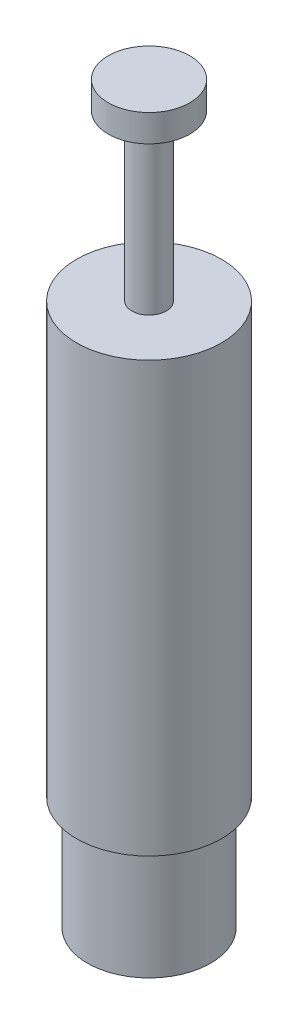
ISO-10303-21;
HEADER;
FILE_DESCRIPTION(('STEP AP214'),'2;1');
FILE_NAME('part.step','',(''),(''),'','','');
FILE_SCHEMA(('AUTOMOTIVE_DESIGN { 1 0 10303 214 1 1 1 1 }'));
ENDSEC;
DATA;
#1=APPLICATION_CONTEXT('core data for automotive mechanical design processes');
#2=APPLICATION_PROTOCOL_DEFINITION('international standard','automotive_design',2000,#1);
#3=PRODUCT_CONTEXT('',#1,'mechanical');
#4=PRODUCT('Part','Part','',(#3));
#5=PRODUCT_RELATED_PRODUCT_CATEGORY('part','',(#4));
#6=PRODUCT_DEFINITION_FORMATION('','',#4);
#7=PRODUCT_DEFINITION_CONTEXT('part definition',#1,'design');
#8=PRODUCT_DEFINITION('design','',#6,#7);
#9=PRODUCT_DEFINITION_SHAPE('','',#8);
#10=(LENGTH_UNIT() NAMED_UNIT(*) SI_UNIT(.MILLI.,.METRE.));
#11=(NAMED_UNIT(*) PLANE_ANGLE_UNIT() SI_UNIT($,.RADIAN.));
#12=(NAMED_UNIT(*) SI_UNIT($,.STERADIAN.) SOLID_ANGLE_UNIT());
#13=UNCERTAINTY_MEASURE_WITH_UNIT(LENGTH_MEASURE(1.E-05),#10,'distance_accuracy_value','');
#14=(GEOMETRIC_REPRESENTATION_CONTEXT(3) GLOBAL_UNCERTAINTY_ASSIGNED_CONTEXT((#13)) GLOBAL_UNIT_ASSIGNED_CONTEXT((#10,
#11,#12)) REPRESENTATION_CONTEXT('',''));
#15=CARTESIAN_POINT('',(0.,0.,0.));
#16=DIRECTION('',(0.,0.,1.));
#17=DIRECTION('',(1.,0.,0.));
#18=AXIS2_PLACEMENT_3D('',#15,#16,#17);
#19=CARTESIAN_POINT('',(0.,0.,0.));
#20=DIRECTION('',(0.,-1.,0.));
#21=DIRECTION('',(0.,0.,-1.));
#22=AXIS2_PLACEMENT_3D('',#19,#20,#21);
#23=PLANE('',#22);
#24=CARTESIAN_POINT('',(0.,0.,0.));
#25=DIRECTION('',(0.,-1.,0.));
#26=DIRECTION('',(0.,0.,-1.));
#27=AXIS2_PLACEMENT_3D('',#24,#25,#26);
#28=CIRCLE('',#27,3.4);
#29=CARTESIAN_POINT('',(0.,0.,-3.4));
#30=VERTEX_POINT('',#29);
#31=EDGE_CURVE('E10',#30,#30,#28,.T.);
#32=ORIENTED_EDGE('',*,*,#31,.T.);
#33=EDGE_LOOP('',(#32));
#34=FACE_BOUND('',#33,.T.);
#35=ADVANCED_FACE('F32',(#34),#23,.T.);
#36=CARTESIAN_POINT('',(0.,0.,0.));
#37=DIRECTION('',(0.,-1.,0.));
#38=DIRECTION('',(0.,0.,-1.));
#39=AXIS2_PLACEMENT_3D('',#36,#37,#38);
#40=CYLINDRICAL_SURFACE('',#39,3.4);
#41=CARTESIAN_POINT('',(0.,6.25,0.));
#42=DIRECTION('',(0.,-1.,0.));
#43=DIRECTION('',(0.,0.,-1.));
#44=AXIS2_PLACEMENT_3D('',#41,#42,#43);
#45=CIRCLE('',#44,3.4);
#46=CARTESIAN_POINT('',(0.,6.25,-3.4));
#47=VERTEX_POINT('',#46);
#48=EDGE_CURVE('E38',#47,#47,#45,.T.);
#49=ORIENTED_EDGE('',*,*,#48,.T.);
#50=EDGE_LOOP('',(#49));
#51=FACE_BOUND('',#50,.T.);
#52=ORIENTED_EDGE('',*,*,#31,.F.);
#53=EDGE_LOOP('',(#52));
#54=FACE_BOUND('',#53,.T.);
#55=ADVANCED_FACE('F76',(#51,#54),#40,.T.);
#56=CARTESIAN_POINT('',(3.4,6.25,0.));
#57=DIRECTION('',(0.,-1.,0.));
#58=DIRECTION('',(0.,0.,-1.));
#59=AXIS2_PLACEMENT_3D('',#56,#57,#58);
#60=PLANE('',#59);
#61=CARTESIAN_POINT('',(0.,6.25,0.));
#62=DIRECTION('',(0.,-1.,0.));
#63=DIRECTION('',(0.,0.,-1.));
#64=AXIS2_PLACEMENT_3D('',#61,#62,#63);
#65=CIRCLE('',#64,4.);
#66=CARTESIAN_POINT('',(0.,6.25,-4.));
#67=VERTEX_POINT('',#66);
#68=EDGE_CURVE('E42',#67,#67,#65,.T.);
#69=ORIENTED_EDGE('',*,*,#68,.T.);
#70=EDGE_LOOP('',(#69));
#71=FACE_BOUND('',#70,.T.);
#72=ORIENTED_EDGE('',*,*,#48,.F.);
#73=EDGE_LOOP('',(#72));
#74=FACE_BOUND('',#73,.T.);
#75=ADVANCED_FACE('F80',(#71,#74),#60,.T.);
#76=CARTESIAN_POINT('',(0.,0.,0.));
#77=DIRECTION('',(0.,-1.,0.));
#78=DIRECTION('',(0.,0.,-1.));
#79=AXIS2_PLACEMENT_3D('',#76,#77,#78);
#80=CYLINDRICAL_SURFACE('',#79,4.);
#81=CARTESIAN_POINT('',(0.,29.95,0.));
#82=DIRECTION('',(0.,-1.,0.));
#83=DIRECTION('',(0.,0.,-1.));
#84=AXIS2_PLACEMENT_3D('',#81,#82,#83);
#85=CIRCLE('',#84,4.);
#86=CARTESIAN_POINT('',(0.,29.95,-4.));
#87=VERTEX_POINT('',#86);
#88=EDGE_CURVE('E46',#87,#87,#85,.T.);
#89=ORIENTED_EDGE('',*,*,#88,.T.);
#90=EDGE_LOOP('',(#89));
#91=FACE_BOUND('',#90,.T.);
#92=ORIENTED_EDGE('',*,*,#68,.F.);
#93=EDGE_LOOP('',(#92));
#94=FACE_BOUND('',#93,.T.);
#95=ADVANCED_FACE('F84',(#91,#94),#80,.T.);
#96=CARTESIAN_POINT('',(4.,29.95,0.));
#97=DIRECTION('',(0.,1.,0.));
#98=DIRECTION('',(0.,0.,1.));
#99=AXIS2_PLACEMENT_3D('',#96,#97,#98);
#100=PLANE('',#99);
#101=CARTESIAN_POINT('',(0.,29.95,0.));
#102=DIRECTION('',(0.,-1.,0.));
#103=DIRECTION('',(0.,0.,-1.));
#104=AXIS2_PLACEMENT_3D('',#101,#102,#103);
#105=CIRCLE('',#104,0.95);
#106=CARTESIAN_POINT('',(0.,29.95,-0.95));
#107=VERTEX_POINT('',#106);
#108=EDGE_CURVE('E51',#107,#107,#105,.T.);
#109=ORIENTED_EDGE('',*,*,#108,.T.);
#110=EDGE_LOOP('',(#109));
#111=FACE_BOUND('',#110,.T.);
#112=ORIENTED_EDGE('',*,*,#88,.F.);
#113=EDGE_LOOP('',(#112));
#114=FACE_BOUND('',#113,.T.);
#115=ADVANCED_FACE('F91',(#111,#114),#100,.T.);
#116=CARTESIAN_POINT('',(0.,0.,0.));
#117=DIRECTION('',(0.,-1.,0.));
#118=DIRECTION('',(0.,0.,-1.));
#119=AXIS2_PLACEMENT_3D('',#116,#117,#118);
#120=CYLINDRICAL_SURFACE('',#119,0.95);
#121=CARTESIAN_POINT('',(0.,39.05,0.));
#122=DIRECTION('',(0.,-1.,0.));
#123=DIRECTION('',(0.,0.,-1.));
#124=AXIS2_PLACEMENT_3D('',#121,#122,#123);
#125=CIRCLE('',#124,0.95);
#126=CARTESIAN_POINT('',(0.,39.05,-0.95));
#127=VERTEX_POINT('',#126);
#128=EDGE_CURVE('E54',#127,#127,#125,.T.);
#129=ORIENTED_EDGE('',*,*,#128,.T.);
#130=EDGE_LOOP('',(#129));
#131=FACE_BOUND('',#130,.T.);
#132=ORIENTED_EDGE('',*,*,#108,.F.);
#133=EDGE_LOOP('',(#132));
#134=FACE_BOUND('',#133,.T.);
#135=ADVANCED_FACE('F95',(#131,#134),#120,.T.);
#136=CARTESIAN_POINT('',(0.95,39.05,0.));
#137=DIRECTION('',(0.,-1.,0.));
#138=DIRECTION('',(0.,0.,-1.));
#139=AXIS2_PLACEMENT_3D('',#136,#137,#138);
#140=PLANE('',#139);
#141=CARTESIAN_POINT('',(0.,39.05,0.));
#142=DIRECTION('',(0.,-1.,0.));
#143=DIRECTION('',(0.,0.,-1.));
#144=AXIS2_PLACEMENT_3D('',#141,#142,#143);
#145=CIRCLE('',#144,2.25);
#146=CARTESIAN_POINT('',(0.,39.05,-2.25));
#147=VERTEX_POINT('',#146);
#148=EDGE_CURVE('E57',#147,#147,#145,.T.);
#149=ORIENTED_EDGE('',*,*,#148,.T.);
#150=EDGE_LOOP('',(#149));
#151=FACE_BOUND('',#150,.T.);
#152=ORIENTED_EDGE('',*,*,#128,.F.);
#153=EDGE_LOOP('',(#152));
#154=FACE_BOUND('',#153,.T.);
#155=ADVANCED_FACE('F73',(#151,#154),#140,.T.);
#156=CARTESIAN_POINT('',(0.,0.,0.));
#157=DIRECTION('',(0.,-1.,0.));
#158=DIRECTION('',(0.,0.,-1.));
#159=AXIS2_PLACEMENT_3D('',#156,#157,#158);
#160=CYLINDRICAL_SURFACE('',#159,2.25);
#161=CARTESIAN_POINT('',(0.,40.55,0.));
#162=DIRECTION('',(0.,-1.,0.));
#163=DIRECTION('',(0.,0.,-1.));
#164=AXIS2_PLACEMENT_3D('',#161,#162,#163);
#165=CIRCLE('',#164,2.25);
#166=CARTESIAN_POINT('',(0.,40.55,-2.25));
#167=VERTEX_POINT('',#166);
#168=EDGE_CURVE('E60',#167,#167,#165,.T.);
#169=ORIENTED_EDGE('',*,*,#168,.T.);
#170=EDGE_LOOP('',(#169));
#171=FACE_BOUND('',#170,.T.);
#172=ORIENTED_EDGE('',*,*,#148,.F.);
#173=EDGE_LOOP('',(#172));
#174=FACE_BOUND('',#173,.T.);
#175=ADVANCED_FACE('F64',(#171,#174),#160,.T.);
#176=CARTESIAN_POINT('',(2.25,40.55,0.));
#177=DIRECTION('',(0.,1.,0.));
#178=DIRECTION('',(0.,0.,1.));
#179=AXIS2_PLACEMENT_3D('',#176,#177,#178);
#180=PLANE('',#179);
#181=ORIENTED_EDGE('',*,*,#168,.F.);
#182=EDGE_LOOP('',(#181));
#183=FACE_BOUND('',#182,.T.);
#184=ADVANCED_FACE('F67',(#183),#180,.T.);
#185=CLOSED_SHELL('',(#35,#55,#75,#95,#115,#135,#155,#175,#184));
#186=MANIFOLD_SOLID_BREP('B2',#185);
#187=ADVANCED_BREP_SHAPE_REPRESENTATION('',(#18,#186),#14);
#188=SHAPE_DEFINITION_REPRESENTATION(#9,#187);
ENDSEC;
END-ISO-10303-21;
